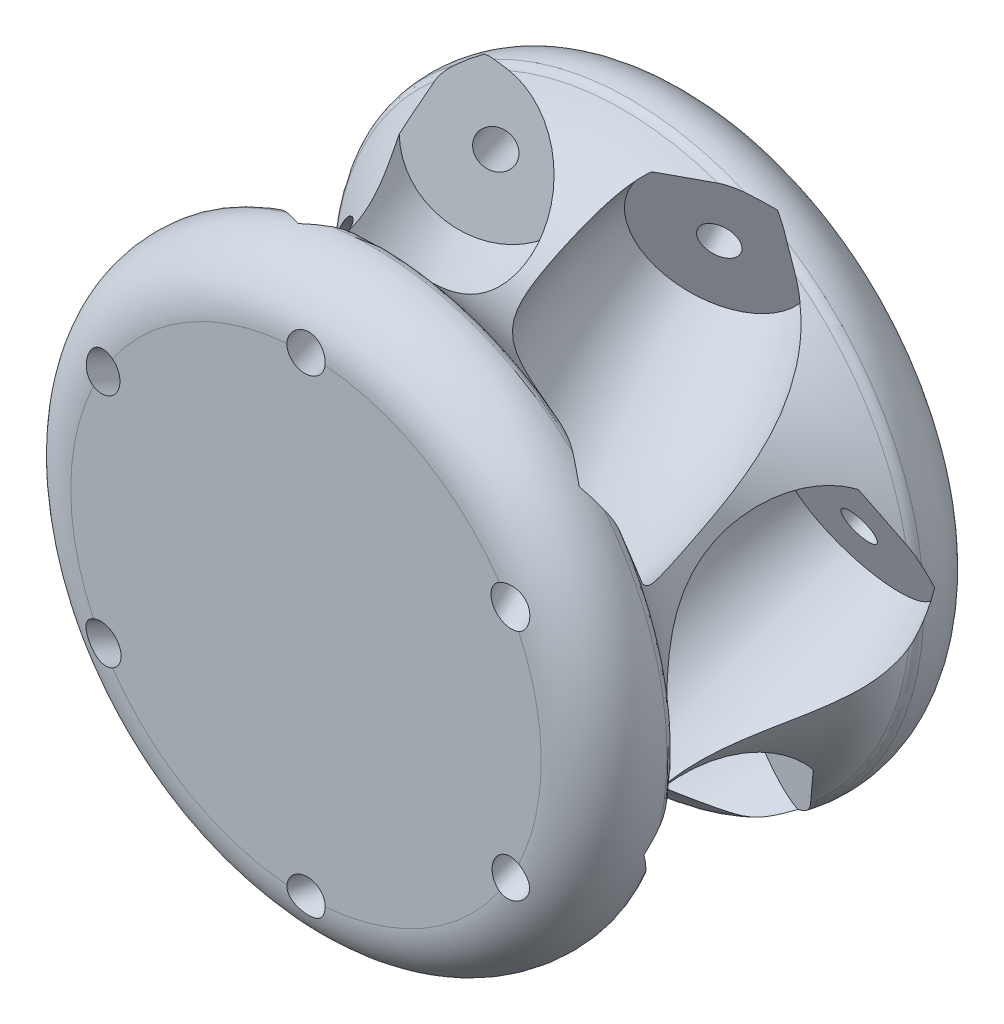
from build123d import *

# Parameters (mm, degrees)
ESQUISSE1_R                  = 25
BOSS_EXTRU_1_DEPTH           = 33.333333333
CONG_1_R                     = 5
R_P_TITION_CIRCULAIRE1_COUNT = 6


with BuildPart() as part:
    # Esquisse1 → Boss.-Extru.1 (new body)
    with BuildSketch(Plane.XY):
        Circle(ESQUISSE1_R)
    extrude(amount=BOSS_EXTRU_1_DEPTH)

    # Cong_1
    cong_1_edges = [part.edges().sort_by_distance(p)[0] for p in [
        (-25, 0, 0),
        (-25, 0, 33.333333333),
    ]]
    fillet(cong_1_edges, radius=CONG_1_R)

    # Esquisse4 → Enl_vement de mati_re-R_volution1 (revolve, cut)
    with BuildSketch(Plane(origin=(-11.984860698, 0, 5.084745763), x_dir=(0.39056673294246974, 0, 0.9205746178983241), z_dir=(-0.9205746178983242, 0, 0.3905667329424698)), mode=Mode.PRIVATE) as enl_vement_de_mati_re_r_volution1_sk:
        with BuildLine():
            Line((37.260319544, 21.063609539), (37.020767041, 22.544357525))
            Line((37.020767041, 22.544357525), (24.681200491, 20.548086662))
            Line((24.681200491, 20.548086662), (23.922617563, 25.237121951))
            ThreePointArc((23.922617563, 25.237121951), (11.21441837, 25.519483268), (-0.756515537, 21.244580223))
            Line((-0.756515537, 21.244580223), (0.002067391, 16.555544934))
            Line((0.002067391, 16.555544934), (-12.337499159, 14.55927407))
            Line((-12.337499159, 14.55927407), (-12.097946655, 13.078526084))
            Line((-12.097946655, 13.078526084), (37.260319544, 21.063609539))
        make_face()
    enl_vement_de_mati_re_r_volution1 = revolve(enl_vement_de_mati_re_r_volution1_sk.sketch.rotate(Axis((-20.676900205, 11.435347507, -15.402587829), (0.3855539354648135, 0.15970166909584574, 0.9087593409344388)), 90), axis=Axis((-20.676900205, 11.435347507, -15.402587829), (0.3855539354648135, 0.15970166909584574, 0.9087593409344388)), mode=Mode.SUBTRACT)

    # Esquisse5 → Enl_vement de mati_re-R_volution2 (revolve, cut)
    with BuildSketch(Plane(origin=(0, 0, 0), x_dir=(1, 0, 0), z_dir=(0, 1, 0)), mode=Mode.PRIVATE) as enl_vement_de_mati_re_r_volution2_sk:
        with BuildLine():
            ThreePointArc((20, -33.333333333), (23.79291146, -31.591219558), (24.942749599, -27.578862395))
            ThreePointArc((24.942749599, -27.578862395), (24.803575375, -27.201967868), (24.527295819, -26.910268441))
            ThreePointArc((24.527295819, -26.910268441), (19.190997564, -16.666666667), (24.527295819, -6.423064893))
            ThreePointArc((24.527295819, -6.423064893), (24.803575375, -6.131365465), (24.942749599, -5.754470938))
            ThreePointArc((24.942749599, -5.754470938), (23.79291146, -1.742113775), (20, 0))
            ThreePointArc((20, 0), (42.400510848, -16.666666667), (20, -33.333333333))
        make_face()
    revolve(enl_vement_de_mati_re_r_volution2_sk.sketch.rotate(Axis((0, 0, 0), (0, 0, 1)), 117.741814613), axis=Axis((0, 0, 0), (0, 0, 1)), mode=Mode.SUBTRACT)

    # R_p_tition circulaire1: Enl_vement de mati_re-R_volution1 ×6 about axis
    r_p_tition_circulaire1_axis = Axis((0, 0, 0), (0, 0, 1))
    for i in range(1, R_P_TITION_CIRCULAIRE1_COUNT):
        add(enl_vement_de_mati_re_r_volution1.rotate(r_p_tition_circulaire1_axis, i * 360 / R_P_TITION_CIRCULAIRE1_COUNT), mode=Mode.SUBTRACT)


solid = part.part
